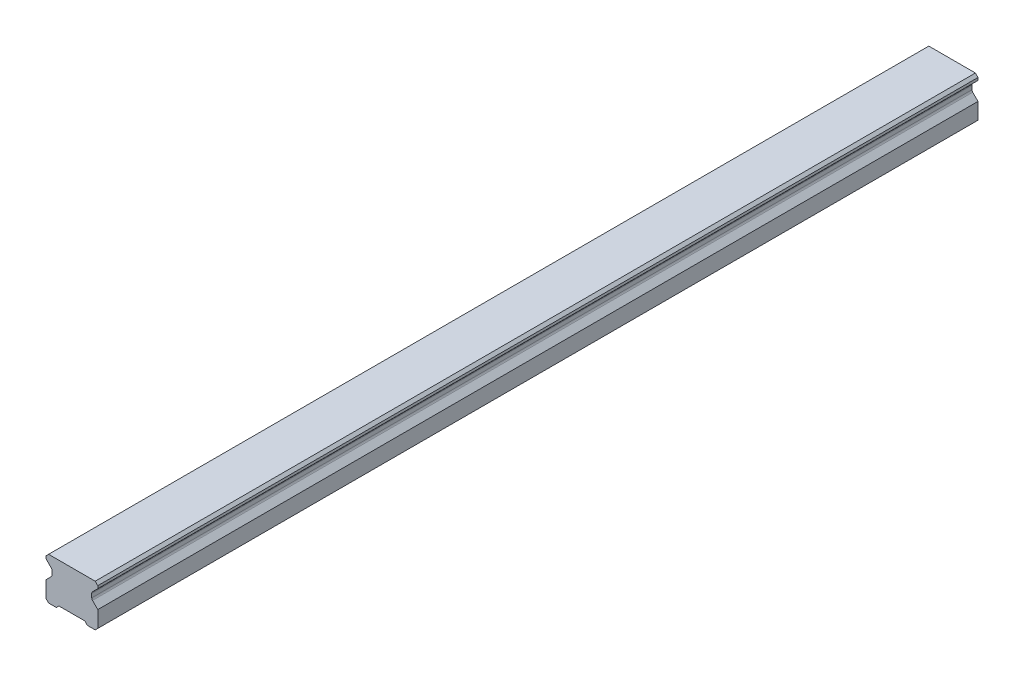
from build123d import *

# Parameters (mm, degrees)
SKETCH1_W           = 20
SKETCH1_H           = 16.3
BOSS_EXTRUDE1_DEPTH = 170
CUT_EXTRUDE1_DEPTH  = 341.537354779
CHAMFER1_SIZE       = 1
FILLET1_R           = 1
CUT_EXTRUDE2_DEPTH  = 341.537354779
SKETCH5_R           = 3
SKETCH5_R_2         = 2.5
CUT_EXTRUDE5_DEPTH  = 10
SKETCH5_2_R         = 2.5
CUT_EXTRUDE6_DEPTH  = 13
LPATTERN2_COUNT     = 6
LPATTERN2_PITCH     = 60


with BuildPart() as part:
    # Sketch1 → Boss-Extrude1 (new, symmetric)
    with BuildSketch(Plane.XY):
        with Locations((0, 8.15)):
            Rectangle(SKETCH1_W, SKETCH1_H)
    extrude(amount=BOSS_EXTRUDE1_DEPTH, both=True)

    # Sketch2 → Cut-Extrude1 (cut, through all)
    with BuildSketch(Plane.XY.offset(170)):
        Polygon((-10, 14.3), (-10, 7.3), (-7.666666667, 9.633333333), (-7.666666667, 11.966666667), align=None)
        Polygon((7.666666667, 11.966666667), (10, 14.3), (10, 7.3), (7.666666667, 9.633333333), align=None)
    extrude(amount=-CUT_EXTRUDE1_DEPTH, mode=Mode.SUBTRACT)

    # Chamfer1
    chamfer1_edges = [part.edges().sort_by_distance(p)[0] for p in [
        (-10, 16.3, 0),
        (10, 16.3, 0),
        (10, 0, 0),
        (-10, 0, 0),
    ]]
    chamfer(chamfer1_edges, length=CHAMFER1_SIZE)

    # Fillet1
    fillet1_edges = [part.edges().sort_by_distance(p)[0] for p in [
        (-7.666666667, 11.966666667, 0),
        (-7.666666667, 9.633333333, 0),
        (7.666666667, 9.633333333, 0),
        (7.666666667, 11.966666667, 0),
    ]]
    fillet(fillet1_edges, radius=FILLET1_R)

    # Sketch3 → Cut-Extrude2 (cut, through all)
    with BuildSketch(Plane.XY.offset(170)):
        Polygon((-6, 0), (-5, 1), (5, 1), (6, 0), align=None)
    extrude(amount=-CUT_EXTRUDE2_DEPTH, mode=Mode.SUBTRACT)

    # Sketch5 → Cut-Extrude5 (cut)
    with BuildSketch(Plane.XZ.offset(-1)):
        with Locations(Location((0, 150, 0), (0, 0, 270))):
            Circle(SKETCH5_R)
        with Locations(Location((0, 150, 0), (0, 0, 270))):
            Circle(SKETCH5_R_2, mode=Mode.SUBTRACT)
    cut_extrude5 = extrude(amount=-CUT_EXTRUDE5_DEPTH, mode=Mode.SUBTRACT)

    # Sketch5_2 → Cut-Extrude6 (cut)
    with BuildSketch(Plane.XZ.offset(-1)):
        with Locations(Location((0, 150, 0), (0, 0, 270))):
            Circle(SKETCH5_2_R)
    cut_extrude6 = extrude(amount=-CUT_EXTRUDE6_DEPTH, mode=Mode.SUBTRACT)

    # Cut-Extrude7 cone 1 section (on through the dimple's axis) → Cut-Extrude7 (revolve, cut)
    with BuildSketch(Plane(origin=(0, 14, 150), x_dir=(0, 0, -1), z_dir=(1, 0, 0))):
        Polygon((0, 0), (2.5, 0), (0, 1.443375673), align=None)
    cut_extrude7 = revolve(axis=Axis((0, 14, 150), (0, 1, 0)), mode=Mode.SUBTRACT)

    # LPattern2: Cut-Extrude5, Cut-Extrude6, Cut-Extrude7 ×6
    with Locations(*[(0, 0, -i * LPATTERN2_PITCH) for i in range(1, LPATTERN2_COUNT)]):
        add(cut_extrude5, mode=Mode.SUBTRACT)
        add(cut_extrude6, mode=Mode.SUBTRACT)
        add(cut_extrude7, mode=Mode.SUBTRACT)


solid = part.part
